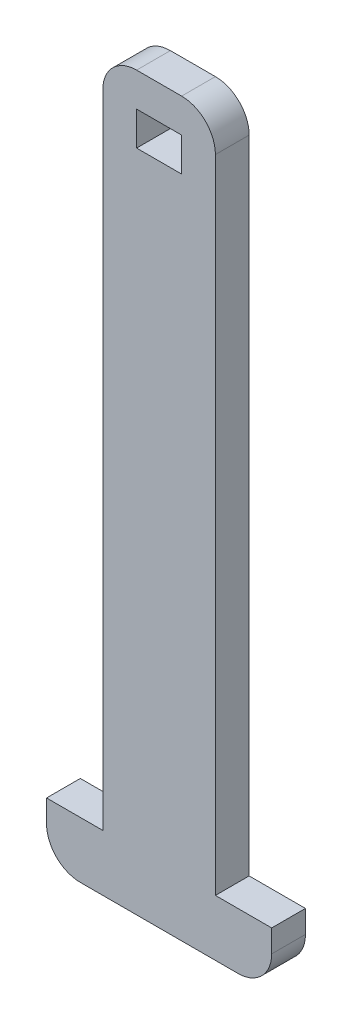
from build123d import *

# Parameters (mm, degrees)
SKETCH_1_W      = 4
SKETCH_1_H      = 3
EXTRUDE_1_DEPTH = 3
FILLET_1_R      = 3


with BuildPart() as part:
    # Sketch 1 → Extrude 1 (new body)
    with BuildSketch(Plane.XY):
        Polygon((0, 21.102941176), (0, -38.897058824), (-5, -38.897058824), (-5, -43.897058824), (15, -43.897058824), (15, -38.897058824), (10, -38.897058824), (10, 21.102941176), align=None)
        with Locations((5, 16.602941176)):
            Rectangle(SKETCH_1_W, SKETCH_1_H, mode=Mode.SUBTRACT)
    extrude(amount=EXTRUDE_1_DEPTH)

    # Fillet 1
    fillet_1_edges = [part.edges().sort_by_distance(p)[0] for p in [
        (10, 21.102941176, 1.5),
        (15, -43.897058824, 1.5),
        (-5, -43.897058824, 1.5),
        (0, 21.102941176, 1.5),
    ]]
    fillet(fillet_1_edges, radius=FILLET_1_R)


solid = part.part
